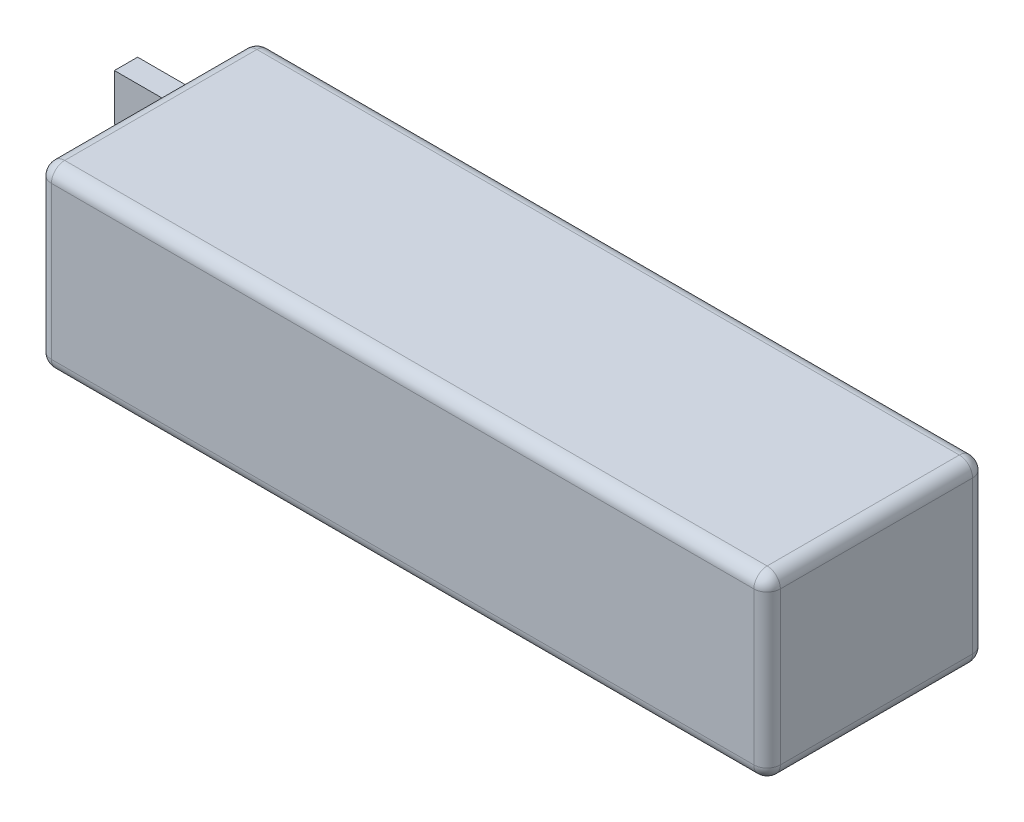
from build123d import *

# Parameters (mm, degrees)
ESBO_O2_W                = 110
ESBO_O2_H                = 33
RESSALTO_EXTRUS_O1_DEPTH = 27
FILETE1_R                = 2
ESBO_O3_W                = 3.5
ESBO_O3_H                = 7
RESSALTO_EXTRUS_O2_DEPTH = 16


with BuildPart() as part:
    # Esbo_o2 → Ressalto-extrus_o1 (new body)
    with BuildSketch(Plane(origin=(0, 0, 0), x_dir=(1, 0, 0), z_dir=(0, 1, 0))):
        with Locations((55, 16.5)):
            Rectangle(ESBO_O2_W, ESBO_O2_H)
    extrude(amount=RESSALTO_EXTRUS_O1_DEPTH)

    # Filete1
    filete1_edges = [part.edges().sort_by_distance(p)[0] for p in [
        (110, 27, -16.5),
        (55, 27, -33),
        (0, 27, -16.5),
        (55, 0, -33),
        (110, 0, -16.5),
        (55, 0, 0),
        (0, 0, -16.5),
        (0, 13.5, -33),
        (110, 13.5, -33),
        (110, 13.5, 0),
        (0, 13.5, 0),
        (55, 27, 0),
    ]]
    fillet(filete1_edges, radius=FILETE1_R)

    # Esbo_o3 → Ressalto-extrus_o2 (add)
    with BuildSketch(Plane.ZY):
        with Locations((-29.25, 13.5)):
            Rectangle(ESBO_O3_W, ESBO_O3_H)
    extrude(amount=RESSALTO_EXTRUS_O2_DEPTH)


solid = part.part
